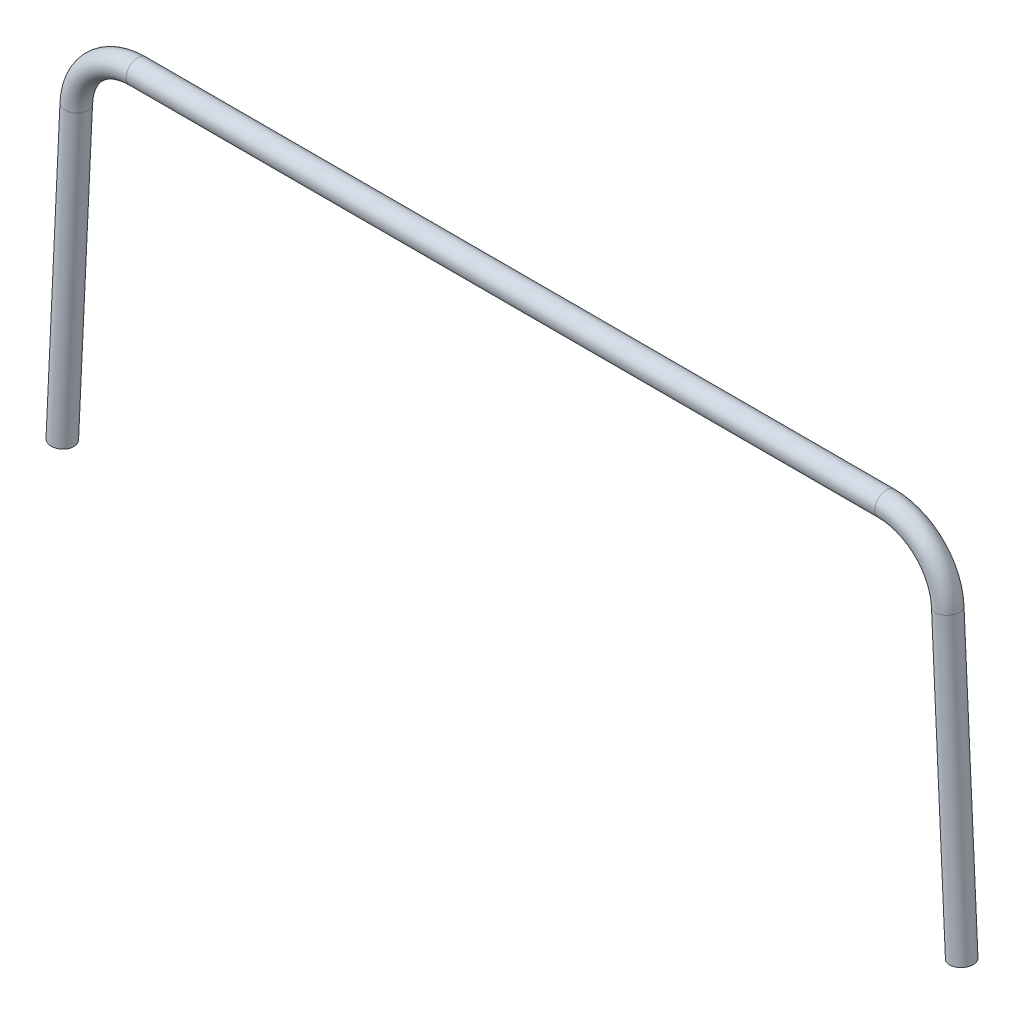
from build123d import *

# Parameters (mm, degrees)
SKETCH11_ON_SEGMENT_1_R    = 19.05
SKETCH11_ON_SEGMENT_1_R_2  = 17.8054
STRUCTURAL_MEMBER1_DEPTH   = 492.914631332
SKETCH11_ON_SEGMENT_2_R    = 19.05
SKETCH11_ON_SEGMENT_2_R_2  = 17.8054
STRUCTURAL_MEMBER1_2_ANGLE = 87.313275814
SKETCH11_ON_SEGMENT_3_R    = 19.05
SKETCH11_ON_SEGMENT_3_R_2  = 17.8054
STRUCTURAL_MEMBER1_3_DEPTH = 1236.670737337
SKETCH11_ON_SEGMENT_4_R    = 19.05
SKETCH11_ON_SEGMENT_4_R_2  = 17.8054
STRUCTURAL_MEMBER1_4_ANGLE = 87.313275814
SKETCH11_R                 = 19.05
SKETCH11_R_2               = 17.8054
STRUCTURAL_MEMBER1_5_DEPTH = 492.914631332


with BuildPart() as part:
    # Sketch11 on segment 1 (on carried to segment 1) → Structural Member1 (new body)
    with BuildSketch(Plane(origin=(719.823686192, -115.8875, 0), x_dir=(0.998900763, 0.046875, 0), z_dir=(0.046875, -0.998900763, 0))):
        Circle(SKETCH11_ON_SEGMENT_1_R)
        Circle(SKETCH11_ON_SEGMENT_1_R_2, mode=Mode.SUBTRACT)
    extrude(amount=STRUCTURAL_MEMBER1_DEPTH)


with BuildPart() as body_2:
    # Sketch11 on segment 2 (on carried to the start of arc 2) → Structural Member1 2 (revolve)
    with BuildSketch(Plane(origin=(618.335368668, -19.05, 0), x_dir=(0, 1, 0), z_dir=(1, 0, 0))):
        Circle(SKETCH11_ON_SEGMENT_2_R)
        Circle(SKETCH11_ON_SEGMENT_2_R_2, mode=Mode.SUBTRACT)
    revolve(axis=Axis((618.335368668, -120.65, 0), (0, 0, -1)), revolution_arc=STRUCTURAL_MEMBER1_2_ANGLE)


with BuildPart() as body_3:
    # Sketch11 on segment 3 (on carried to segment 3) → Structural Member1 3 (new body)
    with BuildSketch(Plane(origin=(-618.335368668, -19.05, 0), x_dir=(0, 1, 0), z_dir=(1, 0, 0))):
        Circle(SKETCH11_ON_SEGMENT_3_R)
        Circle(SKETCH11_ON_SEGMENT_3_R_2, mode=Mode.SUBTRACT)
    extrude(amount=STRUCTURAL_MEMBER1_3_DEPTH)


with BuildPart() as body_4:
    # Sketch11 on segment 4 (on carried to the start of arc 4) → Structural Member1 4 (revolve)
    with BuildSketch(Plane(origin=(-618.335368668, -19.05, 0), x_dir=(0, -1, 0), z_dir=(-1, 0, 0))):
        Circle(SKETCH11_ON_SEGMENT_4_R)
        Circle(SKETCH11_ON_SEGMENT_4_R_2, mode=Mode.SUBTRACT)
    revolve(axis=Axis((-618.335368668, -120.65, 0), (0, 0, 1)), revolution_arc=STRUCTURAL_MEMBER1_4_ANGLE)


with BuildPart() as body_5:
    # Sketch11 → Structural Member1 5 (new body)
    with BuildSketch(Plane(origin=(-719.823686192, -115.8875, 0), x_dir=(0.9989007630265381, -0.046875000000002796, 0), z_dir=(-0.046875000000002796, -0.9989007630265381, 0))):
        Circle(SKETCH11_R)
        Circle(SKETCH11_R_2, mode=Mode.SUBTRACT)
    extrude(amount=STRUCTURAL_MEMBER1_5_DEPTH)


solid = Compound([part.part, body_2.part, body_3.part, body_4.part, body_5.part])
